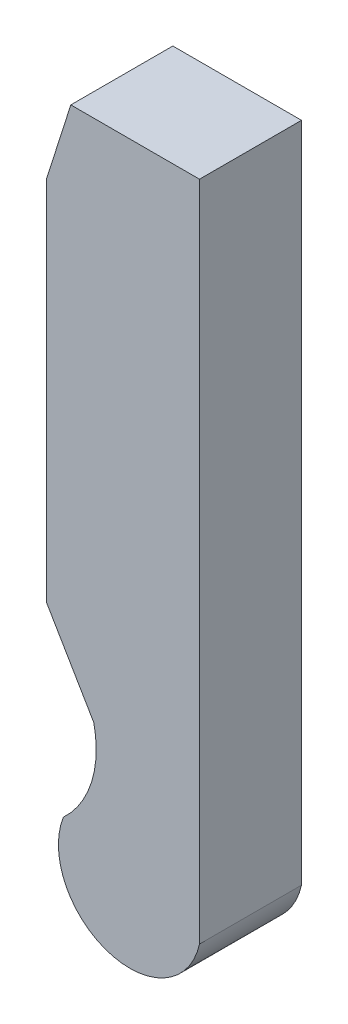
ISO-10303-21;
HEADER;
FILE_DESCRIPTION(('STEP AP214'),'2;1');
FILE_NAME('part.step','',(''),(''),'','','');
FILE_SCHEMA(('AUTOMOTIVE_DESIGN { 1 0 10303 214 1 1 1 1 }'));
ENDSEC;
DATA;
#1=APPLICATION_CONTEXT('core data for automotive mechanical design processes');
#2=APPLICATION_PROTOCOL_DEFINITION('international standard','automotive_design',2000,#1);
#3=PRODUCT_CONTEXT('',#1,'mechanical');
#4=PRODUCT('Part','Part','',(#3));
#5=PRODUCT_RELATED_PRODUCT_CATEGORY('part','',(#4));
#6=PRODUCT_DEFINITION_FORMATION('','',#4);
#7=PRODUCT_DEFINITION_CONTEXT('part definition',#1,'design');
#8=PRODUCT_DEFINITION('design','',#6,#7);
#9=PRODUCT_DEFINITION_SHAPE('','',#8);
#10=(LENGTH_UNIT() NAMED_UNIT(*) SI_UNIT(.MILLI.,.METRE.));
#11=(NAMED_UNIT(*) PLANE_ANGLE_UNIT() SI_UNIT($,.RADIAN.));
#12=(NAMED_UNIT(*) SI_UNIT($,.STERADIAN.) SOLID_ANGLE_UNIT());
#13=UNCERTAINTY_MEASURE_WITH_UNIT(LENGTH_MEASURE(1.E-05),#10,'distance_accuracy_value','');
#14=(GEOMETRIC_REPRESENTATION_CONTEXT(3) GLOBAL_UNCERTAINTY_ASSIGNED_CONTEXT((#13)) GLOBAL_UNIT_ASSIGNED_CONTEXT((#10,
#11,#12)) REPRESENTATION_CONTEXT('',''));
#15=CARTESIAN_POINT('',(0.,0.,0.));
#16=DIRECTION('',(0.,0.,1.));
#17=DIRECTION('',(1.,0.,0.));
#18=AXIS2_PLACEMENT_3D('',#15,#16,#17);
#19=CARTESIAN_POINT('',(4.23087543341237,1.91152135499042,2.54));
#20=DIRECTION('',(0.,0.,-1.));
#21=DIRECTION('',(-1.,0.,0.));
#22=AXIS2_PLACEMENT_3D('',#19,#20,#21);
#23=CYLINDRICAL_SURFACE('',#22,1.778);
#24=CARTESIAN_POINT('',(4.23087543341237,1.91152135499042,0.));
#25=DIRECTION('',(0.,0.,1.));
#26=DIRECTION('',(1.,0.,0.));
#27=AXIS2_PLACEMENT_3D('',#24,#25,#26);
#28=CIRCLE('',#27,1.778);
#29=CARTESIAN_POINT('',(2.57895660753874,2.56912928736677,0.));
#30=VERTEX_POINT('',#29);
#31=CARTESIAN_POINT('',(5.96625625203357,1.52456216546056,0.));
#32=VERTEX_POINT('',#31);
#33=EDGE_CURVE('E123',#30,#32,#28,.T.);
#34=ORIENTED_EDGE('',*,*,#33,.T.);
#35=DIRECTION('',(0.,0.,-1.));
#36=VECTOR('',#35,1.);
#37=CARTESIAN_POINT('',(5.96625625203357,1.52456216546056,2.54));
#38=LINE('',#37,#36);
#39=CARTESIAN_POINT('',(5.96625625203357,1.52456216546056,2.54));
#40=VERTEX_POINT('',#39);
#41=EDGE_CURVE('E11',#40,#32,#38,.T.);
#42=ORIENTED_EDGE('',*,*,#41,.F.);
#43=CARTESIAN_POINT('',(4.23087543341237,1.91152135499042,2.54));
#44=DIRECTION('',(0.,0.,1.));
#45=DIRECTION('',(1.,0.,0.));
#46=AXIS2_PLACEMENT_3D('',#43,#44,#45);
#47=CIRCLE('',#46,1.778);
#48=CARTESIAN_POINT('',(2.57895660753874,2.56912928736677,2.54));
#49=VERTEX_POINT('',#48);
#50=EDGE_CURVE('E135',#49,#40,#47,.T.);
#51=ORIENTED_EDGE('',*,*,#50,.F.);
#52=DIRECTION('',(0.,0.,-1.));
#53=VECTOR('',#52,1.);
#54=CARTESIAN_POINT('',(2.57895660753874,2.56912928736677,2.54));
#55=LINE('',#54,#53);
#56=EDGE_CURVE('E119',#49,#30,#55,.T.);
#57=ORIENTED_EDGE('',*,*,#56,.T.);
#58=EDGE_LOOP('',(#34,#42,#51,#57));
#59=FACE_BOUND('',#58,.T.);
#60=ADVANCED_FACE('F33',(#59),#23,.T.);
#61=CARTESIAN_POINT('',(5.96625625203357,1.52456216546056,2.54));
#62=DIRECTION('',(-1.,0.,0.));
#63=DIRECTION('',(0.,0.,1.));
#64=AXIS2_PLACEMENT_3D('',#61,#62,#63);
#65=PLANE('',#64);
#66=DIRECTION('',(0.,1.,0.));
#67=VECTOR('',#66,1.);
#68=CARTESIAN_POINT('',(5.96625625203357,1.52456216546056,0.));
#69=LINE('',#68,#67);
#70=CARTESIAN_POINT('',(5.96625625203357,18.019390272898,0.));
#71=VERTEX_POINT('',#70);
#72=EDGE_CURVE('E126',#32,#71,#69,.T.);
#73=ORIENTED_EDGE('',*,*,#72,.T.);
#74=DIRECTION('',(0.,0.,-1.));
#75=VECTOR('',#74,1.);
#76=CARTESIAN_POINT('',(5.96625625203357,18.019390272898,2.54));
#77=LINE('',#76,#75);
#78=CARTESIAN_POINT('',(5.96625625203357,18.019390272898,2.54));
#79=VERTEX_POINT('',#78);
#80=EDGE_CURVE('E41',#79,#71,#77,.T.);
#81=ORIENTED_EDGE('',*,*,#80,.F.);
#82=DIRECTION('',(0.,1.,0.));
#83=VECTOR('',#82,1.);
#84=CARTESIAN_POINT('',(5.96625625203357,1.52456216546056,2.54));
#85=LINE('',#84,#83);
#86=EDGE_CURVE('E89',#40,#79,#85,.T.);
#87=ORIENTED_EDGE('',*,*,#86,.F.);
#88=ORIENTED_EDGE('',*,*,#41,.T.);
#89=EDGE_LOOP('',(#73,#81,#87,#88));
#90=FACE_BOUND('',#89,.T.);
#91=ADVANCED_FACE('F160',(#90),#65,.F.);
#92=CARTESIAN_POINT('',(2.76180728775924,18.019390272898,2.54));
#93=DIRECTION('',(0.,-1.,0.));
#94=DIRECTION('',(0.,0.,-1.));
#95=AXIS2_PLACEMENT_3D('',#92,#93,#94);
#96=PLANE('',#95);
#97=DIRECTION('',(-1.,0.,0.));
#98=VECTOR('',#97,1.);
#99=CARTESIAN_POINT('',(2.76180728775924,18.019390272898,0.));
#100=LINE('',#99,#98);
#101=CARTESIAN_POINT('',(2.76180728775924,18.019390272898,0.));
#102=VERTEX_POINT('',#101);
#103=EDGE_CURVE('E128',#71,#102,#100,.T.);
#104=ORIENTED_EDGE('',*,*,#103,.T.);
#105=DIRECTION('',(0.,0.,-1.));
#106=VECTOR('',#105,1.);
#107=CARTESIAN_POINT('',(2.76180728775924,18.019390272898,2.54));
#108=LINE('',#107,#106);
#109=CARTESIAN_POINT('',(2.76180728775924,18.019390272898,2.54));
#110=VERTEX_POINT('',#109);
#111=EDGE_CURVE('E139',#110,#102,#108,.T.);
#112=ORIENTED_EDGE('',*,*,#111,.F.);
#113=DIRECTION('',(-1.,0.,0.));
#114=VECTOR('',#113,1.);
#115=CARTESIAN_POINT('',(2.76180728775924,18.019390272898,2.54));
#116=LINE('',#115,#114);
#117=EDGE_CURVE('E147',#79,#110,#116,.T.);
#118=ORIENTED_EDGE('',*,*,#117,.F.);
#119=ORIENTED_EDGE('',*,*,#80,.T.);
#120=EDGE_LOOP('',(#104,#112,#118,#119));
#121=FACE_BOUND('',#120,.T.);
#122=ADVANCED_FACE('F145',(#121),#96,.F.);
#123=CARTESIAN_POINT('',(2.76180728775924,18.019390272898,2.54));
#124=DIRECTION('',(0.952732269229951,-0.303811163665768,0.));
#125=DIRECTION('',(0.303811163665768,0.952732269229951,0.));
#126=AXIS2_PLACEMENT_3D('',#123,#124,#125);
#127=PLANE('',#126);
#128=DIRECTION('',(-0.303811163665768,-0.952732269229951,0.));
#129=VECTOR('',#128,1.);
#130=CARTESIAN_POINT('',(2.76180728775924,18.019390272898,0.));
#131=LINE('',#130,#129);
#132=CARTESIAN_POINT('',(2.15625625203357,16.1204211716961,0.));
#133=VERTEX_POINT('',#132);
#134=EDGE_CURVE('E130',#102,#133,#131,.T.);
#135=ORIENTED_EDGE('',*,*,#134,.T.);
#136=DIRECTION('',(0.,0.,-1.));
#137=VECTOR('',#136,1.);
#138=CARTESIAN_POINT('',(2.15625625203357,16.1204211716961,2.54));
#139=LINE('',#138,#137);
#140=CARTESIAN_POINT('',(2.15625625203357,16.1204211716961,2.54));
#141=VERTEX_POINT('',#140);
#142=EDGE_CURVE('E114',#141,#133,#139,.T.);
#143=ORIENTED_EDGE('',*,*,#142,.F.);
#144=DIRECTION('',(-0.303811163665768,-0.952732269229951,0.));
#145=VECTOR('',#144,1.);
#146=CARTESIAN_POINT('',(2.76180728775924,18.019390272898,2.54));
#147=LINE('',#146,#145);
#148=EDGE_CURVE('E105',#110,#141,#147,.T.);
#149=ORIENTED_EDGE('',*,*,#148,.F.);
#150=ORIENTED_EDGE('',*,*,#111,.T.);
#151=EDGE_LOOP('',(#135,#143,#149,#150));
#152=FACE_BOUND('',#151,.T.);
#153=ADVANCED_FACE('F153',(#152),#127,.F.);
#154=CARTESIAN_POINT('',(2.15625625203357,16.1204211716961,2.54));
#155=DIRECTION('',(1.,0.,0.));
#156=DIRECTION('',(0.,1.,0.));
#157=AXIS2_PLACEMENT_3D('',#154,#155,#156);
#158=PLANE('',#157);
#159=DIRECTION('',(0.,-1.,0.));
#160=VECTOR('',#159,1.);
#161=CARTESIAN_POINT('',(2.15625625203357,16.1204211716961,0.));
#162=LINE('',#161,#160);
#163=CARTESIAN_POINT('',(2.15625625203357,6.98726566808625,0.));
#164=VERTEX_POINT('',#163);
#165=EDGE_CURVE('E113',#133,#164,#162,.T.);
#166=ORIENTED_EDGE('',*,*,#165,.T.);
#167=DIRECTION('',(0.,0.,-1.));
#168=VECTOR('',#167,1.);
#169=CARTESIAN_POINT('',(2.15625625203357,6.98726566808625,2.54));
#170=LINE('',#169,#168);
#171=CARTESIAN_POINT('',(2.15625625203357,6.98726566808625,2.54));
#172=VERTEX_POINT('',#171);
#173=EDGE_CURVE('E110',#172,#164,#170,.T.);
#174=ORIENTED_EDGE('',*,*,#173,.F.);
#175=DIRECTION('',(0.,-1.,0.));
#176=VECTOR('',#175,1.);
#177=CARTESIAN_POINT('',(2.15625625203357,16.1204211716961,2.54));
#178=LINE('',#177,#176);
#179=EDGE_CURVE('E99',#141,#172,#178,.T.);
#180=ORIENTED_EDGE('',*,*,#179,.F.);
#181=ORIENTED_EDGE('',*,*,#142,.T.);
#182=EDGE_LOOP('',(#166,#174,#180,#181));
#183=FACE_BOUND('',#182,.T.);
#184=ADVANCED_FACE('F111',(#183),#158,.F.);
#185=CARTESIAN_POINT('',(3.33406314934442,4.98499394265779,2.54));
#186=DIRECTION('',(0.86193421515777,0.507020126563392,0.));
#187=DIRECTION('',(-0.507020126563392,0.861934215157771,0.));
#188=AXIS2_PLACEMENT_3D('',#185,#186,#187);
#189=PLANE('',#188);
#190=DIRECTION('',(0.507020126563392,-0.86193421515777,0.));
#191=VECTOR('',#190,1.);
#192=CARTESIAN_POINT('',(3.33406314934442,4.98499394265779,0.));
#193=LINE('',#192,#191);
#194=CARTESIAN_POINT('',(3.33406314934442,4.98499394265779,0.));
#195=VERTEX_POINT('',#194);
#196=EDGE_CURVE('E75',#164,#195,#193,.T.);
#197=ORIENTED_EDGE('',*,*,#196,.T.);
#198=DIRECTION('',(0.,0.,-1.));
#199=VECTOR('',#198,1.);
#200=CARTESIAN_POINT('',(3.33406314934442,4.98499394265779,2.54));
#201=LINE('',#200,#199);
#202=CARTESIAN_POINT('',(3.33406314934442,4.98499394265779,2.54));
#203=VERTEX_POINT('',#202);
#204=EDGE_CURVE('E115',#203,#195,#201,.T.);
#205=ORIENTED_EDGE('',*,*,#204,.F.);
#206=DIRECTION('',(0.507020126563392,-0.86193421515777,0.));
#207=VECTOR('',#206,1.);
#208=CARTESIAN_POINT('',(3.33406314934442,4.98499394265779,2.54));
#209=LINE('',#208,#207);
#210=EDGE_CURVE('E103',#172,#203,#209,.T.);
#211=ORIENTED_EDGE('',*,*,#210,.F.);
#212=ORIENTED_EDGE('',*,*,#173,.T.);
#213=EDGE_LOOP('',(#197,#205,#211,#212));
#214=FACE_BOUND('',#213,.T.);
#215=ADVANCED_FACE('F117',(#214),#189,.F.);
#216=CARTESIAN_POINT('',(0.854532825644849,4.43405894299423,2.54));
#217=DIRECTION('',(0.,0.,-1.));
#218=DIRECTION('',(-1.,0.,0.));
#219=AXIS2_PLACEMENT_3D('',#216,#217,#218);
#220=CYLINDRICAL_SURFACE('',#219,2.54);
#221=CARTESIAN_POINT('',(0.854532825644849,4.43405894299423,0.));
#222=DIRECTION('',(0.,0.,-1.));
#223=DIRECTION('',(1.,0.,0.));
#224=AXIS2_PLACEMENT_3D('',#221,#222,#223);
#225=CIRCLE('',#224,2.54);
#226=EDGE_CURVE('E81',#195,#30,#225,.T.);
#227=ORIENTED_EDGE('',*,*,#226,.T.);
#228=ORIENTED_EDGE('',*,*,#56,.F.);
#229=CARTESIAN_POINT('',(0.854532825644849,4.43405894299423,2.54));
#230=DIRECTION('',(0.,0.,-1.));
#231=DIRECTION('',(1.,0.,0.));
#232=AXIS2_PLACEMENT_3D('',#229,#230,#231);
#233=CIRCLE('',#232,2.54);
#234=EDGE_CURVE('E49',#203,#49,#233,.T.);
#235=ORIENTED_EDGE('',*,*,#234,.F.);
#236=ORIENTED_EDGE('',*,*,#204,.T.);
#237=EDGE_LOOP('',(#227,#228,#235,#236));
#238=FACE_BOUND('',#237,.T.);
#239=ADVANCED_FACE('F174',(#238),#220,.F.);
#240=CARTESIAN_POINT('',(4.23087543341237,1.91152135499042,2.54));
#241=DIRECTION('',(0.,0.,1.));
#242=DIRECTION('',(1.,0.,0.));
#243=AXIS2_PLACEMENT_3D('',#240,#241,#242);
#244=PLANE('',#243);
#245=ORIENTED_EDGE('',*,*,#50,.T.);
#246=ORIENTED_EDGE('',*,*,#86,.T.);
#247=ORIENTED_EDGE('',*,*,#117,.T.);
#248=ORIENTED_EDGE('',*,*,#148,.T.);
#249=ORIENTED_EDGE('',*,*,#179,.T.);
#250=ORIENTED_EDGE('',*,*,#210,.T.);
#251=ORIENTED_EDGE('',*,*,#234,.T.);
#252=EDGE_LOOP('',(#245,#246,#247,#248,#249,#250,#251));
#253=FACE_BOUND('',#252,.T.);
#254=ADVANCED_FACE('F101',(#253),#244,.T.);
#255=CARTESIAN_POINT('',(4.23087543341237,1.91152135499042,0.));
#256=DIRECTION('',(0.,0.,1.));
#257=DIRECTION('',(1.,0.,0.));
#258=AXIS2_PLACEMENT_3D('',#255,#256,#257);
#259=PLANE('',#258);
#260=ORIENTED_EDGE('',*,*,#33,.F.);
#261=ORIENTED_EDGE('',*,*,#226,.F.);
#262=ORIENTED_EDGE('',*,*,#196,.F.);
#263=ORIENTED_EDGE('',*,*,#165,.F.);
#264=ORIENTED_EDGE('',*,*,#134,.F.);
#265=ORIENTED_EDGE('',*,*,#103,.F.);
#266=ORIENTED_EDGE('',*,*,#72,.F.);
#267=EDGE_LOOP('',(#260,#261,#262,#263,#264,#265,#266));
#268=FACE_BOUND('',#267,.T.);
#269=ADVANCED_FACE('F151',(#268),#259,.F.);
#270=CLOSED_SHELL('',(#60,#91,#122,#153,#184,#215,#239,#254,#269));
#271=MANIFOLD_SOLID_BREP('B2',#270);
#272=ADVANCED_BREP_SHAPE_REPRESENTATION('',(#18,#271),#14);
#273=SHAPE_DEFINITION_REPRESENTATION(#9,#272);
ENDSEC;
END-ISO-10303-21;
